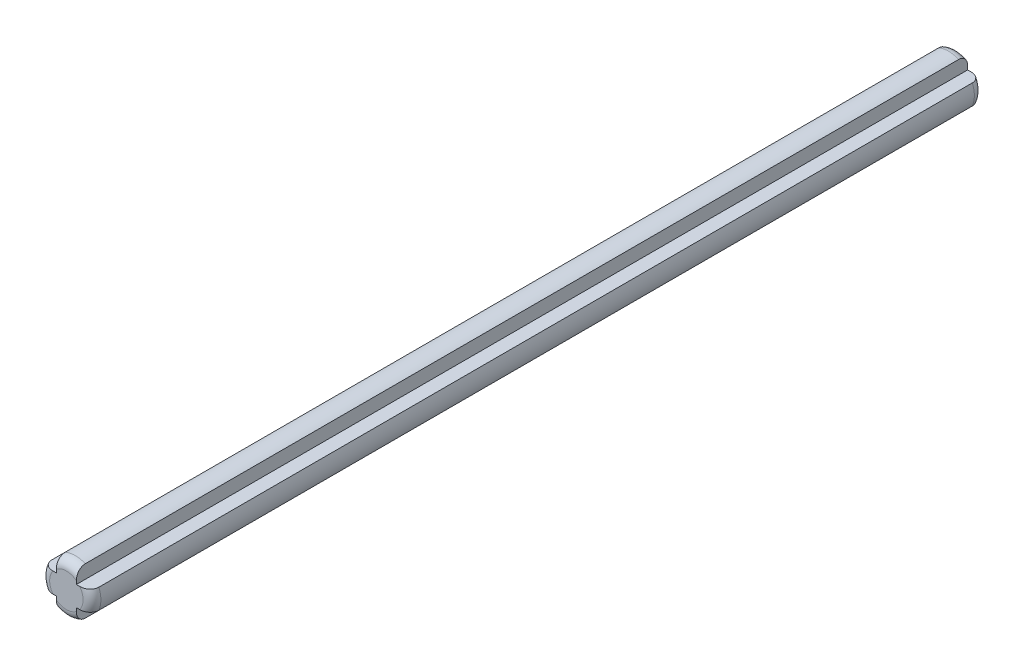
ISO-10303-21;
HEADER;
FILE_DESCRIPTION(('STEP AP214'),'2;1');
FILE_NAME('part.step','',(''),(''),'','','');
FILE_SCHEMA(('AUTOMOTIVE_DESIGN { 1 0 10303 214 1 1 1 1 }'));
ENDSEC;
DATA;
#1=APPLICATION_CONTEXT('core data for automotive mechanical design processes');
#2=APPLICATION_PROTOCOL_DEFINITION('international standard','automotive_design',2000,#1);
#3=PRODUCT_CONTEXT('',#1,'mechanical');
#4=PRODUCT('Part','Part','',(#3));
#5=PRODUCT_RELATED_PRODUCT_CATEGORY('part','',(#4));
#6=PRODUCT_DEFINITION_FORMATION('','',#4);
#7=PRODUCT_DEFINITION_CONTEXT('part definition',#1,'design');
#8=PRODUCT_DEFINITION('design','',#6,#7);
#9=PRODUCT_DEFINITION_SHAPE('','',#8);
#10=(LENGTH_UNIT() NAMED_UNIT(*) SI_UNIT(.MILLI.,.METRE.));
#11=(NAMED_UNIT(*) PLANE_ANGLE_UNIT() SI_UNIT($,.RADIAN.));
#12=(NAMED_UNIT(*) SI_UNIT($,.STERADIAN.) SOLID_ANGLE_UNIT());
#13=UNCERTAINTY_MEASURE_WITH_UNIT(LENGTH_MEASURE(1.E-05),#10,'distance_accuracy_value','');
#14=(GEOMETRIC_REPRESENTATION_CONTEXT(3) GLOBAL_UNCERTAINTY_ASSIGNED_CONTEXT((#13)) GLOBAL_UNIT_ASSIGNED_CONTEXT((#10,
#11,#12)) REPRESENTATION_CONTEXT('',''));
#15=CARTESIAN_POINT('',(0.,0.,0.));
#16=DIRECTION('',(0.,0.,1.));
#17=DIRECTION('',(1.,0.,0.));
#18=AXIS2_PLACEMENT_3D('',#15,#16,#17);
#19=CARTESIAN_POINT('',(0.9,0.,-80.));
#20=DIRECTION('',(-1.,0.,0.));
#21=DIRECTION('',(0.,0.,1.));
#22=AXIS2_PLACEMENT_3D('',#19,#20,#21);
#23=PLANE('',#22);
#24=DIRECTION('',(0.,-1.,0.));
#25=VECTOR('',#24,1.);
#26=CARTESIAN_POINT('',(0.9,0.,-80.));
#27=LINE('',#26,#25);
#28=CARTESIAN_POINT('',(0.9,1.2,-80.));
#29=VERTEX_POINT('',#28);
#30=CARTESIAN_POINT('',(0.9,0.9,-80.));
#31=VERTEX_POINT('',#30);
#32=EDGE_CURVE('E218',#29,#31,#27,.T.);
#33=ORIENTED_EDGE('',*,*,#32,.F.);
#34=CARTESIAN_POINT('',(0.9,1.2,-80.));
#35=CARTESIAN_POINT('',(0.9,1.23177264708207,-79.9999988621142));
#36=CARTESIAN_POINT('',(0.9,1.26353737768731,-79.9987861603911));
#37=CARTESIAN_POINT('',(0.9,1.32690893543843,-79.9937439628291));
#38=CARTESIAN_POINT('',(0.9,1.35851541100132,-79.9899101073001));
#39=CARTESIAN_POINT('',(0.9,1.45291091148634,-79.9741597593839));
#40=CARTESIAN_POINT('',(0.9,1.51508424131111,-79.9579921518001));
#41=CARTESIAN_POINT('',(0.9,1.62122301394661,-79.9186762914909));
#42=CARTESIAN_POINT('',(0.9,1.66610240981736,-79.8979677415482));
#43=CARTESIAN_POINT('',(0.9,1.7517430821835,-79.8494286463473));
#44=CARTESIAN_POINT('',(0.9,1.79251387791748,-79.8216151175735));
#45=CARTESIAN_POINT('',(0.9,1.86875694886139,-79.7590609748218));
#46=CARTESIAN_POINT('',(0.9,1.90419849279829,-79.7242826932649));
#47=CARTESIAN_POINT('',(0.9,1.96804173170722,-79.6487024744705));
#48=CARTESIAN_POINT('',(0.9,1.99643996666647,-79.607897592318));
#49=CARTESIAN_POINT('',(0.9,2.04263429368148,-79.5255349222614));
#50=CARTESIAN_POINT('',(0.9,2.06116131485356,-79.4843855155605));
#51=CARTESIAN_POINT('',(0.9,2.09051404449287,-79.3994647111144));
#52=CARTESIAN_POINT('',(0.9,2.10135386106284,-79.3556982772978));
#53=CARTESIAN_POINT('',(0.9,2.11095369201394,-79.2929302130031));
#54=CARTESIAN_POINT('',(0.9,2.11307132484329,-79.2743928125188));
#55=CARTESIAN_POINT('',(0.9,2.11589349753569,-79.2372401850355));
#56=CARTESIAN_POINT('',(0.9,2.1166002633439,-79.218625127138));
#57=CARTESIAN_POINT('',(0.9,2.11660104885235,-79.2000000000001));
#58=B_SPLINE_CURVE_WITH_KNOTS('',3,(#34,#35,#36,#37,#38,#39,#40,#41,#42,#43,#44,#45,#46,#47,#48,
#49,#50,#51,#52,#53,#54,#55,#56,#57),.UNSPECIFIED.,.F.,.F.,(4,2,2,2,2,2,2,2,2,2,2,4),(0.,
0.0952699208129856,0.19069868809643,0.382124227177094,0.529802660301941,0.677130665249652,
0.825278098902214,0.973498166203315,1.10819470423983,1.24264339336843,1.29857368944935,
1.35441567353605),.UNSPECIFIED.);
#59=CARTESIAN_POINT('',(0.9,2.11660104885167,-79.2));
#60=VERTEX_POINT('',#59);
#61=EDGE_CURVE('E412',#29,#60,#58,.T.);
#62=ORIENTED_EDGE('',*,*,#61,.T.);
#63=DIRECTION('',(0.,0.,1.));
#64=VECTOR('',#63,1.);
#65=CARTESIAN_POINT('',(0.9,2.11660104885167,-80.));
#66=LINE('',#65,#64);
#67=CARTESIAN_POINT('',(0.9,2.11660104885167,-0.799999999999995));
#68=VERTEX_POINT('',#67);
#69=EDGE_CURVE('E255',#60,#68,#66,.T.);
#70=ORIENTED_EDGE('',*,*,#69,.T.);
#71=CARTESIAN_POINT('',(0.9,2.11660104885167,-0.799999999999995));
#72=CARTESIAN_POINT('',(0.9,2.11664820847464,-0.7578675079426));
#73=CARTESIAN_POINT('',(0.9,2.11298761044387,-0.715759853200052));
#74=CARTESIAN_POINT('',(0.9,2.09861504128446,-0.632869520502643));
#75=CARTESIAN_POINT('',(0.9,2.08792060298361,-0.59208381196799));
#76=CARTESIAN_POINT('',(0.9,2.05984193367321,-0.512893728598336));
#77=CARTESIAN_POINT('',(0.9,2.0424580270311,-0.474489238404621));
#78=CARTESIAN_POINT('',(0.9,2.00163237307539,-0.401044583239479));
#79=CARTESIAN_POINT('',(0.9,1.9781885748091,-0.366005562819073));
#80=CARTESIAN_POINT('',(0.9,1.92541056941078,-0.299327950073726));
#81=CARTESIAN_POINT('',(0.9,1.89594969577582,-0.267789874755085));
#82=CARTESIAN_POINT('',(0.9,1.83247761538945,-0.209727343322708));
#83=CARTESIAN_POINT('',(0.9,1.79846712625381,-0.18320209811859));
#84=CARTESIAN_POINT('',(0.9,1.72434385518,-0.133829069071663));
#85=CARTESIAN_POINT('',(0.9,1.68396944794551,-0.111374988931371));
#86=CARTESIAN_POINT('',(0.9,1.60027120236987,-0.0727387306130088));
#87=CARTESIAN_POINT('',(0.9,1.55694210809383,-0.0565680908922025));
#88=CARTESIAN_POINT('',(0.9,1.46195018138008,-0.0284954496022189));
#89=CARTESIAN_POINT('',(0.9,1.40999804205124,-0.0175692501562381));
#90=CARTESIAN_POINT('',(0.9,1.33146710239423,-0.00688571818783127));
#91=CARTESIAN_POINT('',(0.9,1.30523100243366,-0.00427515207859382));
#92=CARTESIAN_POINT('',(0.9,1.25266468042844,-0.000833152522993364));
#93=CARTESIAN_POINT('',(0.9,1.22633456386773,-1.25965898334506E-07));
#94=CARTESIAN_POINT('',(0.9,1.2,0.));
#95=B_SPLINE_CURVE_WITH_KNOTS('',3,(#71,#72,#73,#74,#75,#76,#77,#78,#79,#80,#81,#82,#83,#84,#85,
#86,#87,#88,#89,#90,#91,#92,#93,#94),.UNSPECIFIED.,.F.,.F.,(4,2,2,2,2,2,2,2,2,2,2,4),(0.,
0.12620055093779,0.252087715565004,0.377968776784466,0.503892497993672,0.632806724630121,
0.761700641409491,0.899726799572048,1.03800523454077,1.19659344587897,1.27564166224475,
1.35461900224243),.UNSPECIFIED.);
#96=CARTESIAN_POINT('',(0.9,1.2,0.));
#97=VERTEX_POINT('',#96);
#98=EDGE_CURVE('E420',#68,#97,#95,.T.);
#99=ORIENTED_EDGE('',*,*,#98,.T.);
#100=DIRECTION('',(0.,-1.,0.));
#101=VECTOR('',#100,1.);
#102=CARTESIAN_POINT('',(0.9,0.,0.));
#103=LINE('',#102,#101);
#104=CARTESIAN_POINT('',(0.9,0.9,0.));
#105=VERTEX_POINT('',#104);
#106=EDGE_CURVE('E256',#97,#105,#103,.T.);
#107=ORIENTED_EDGE('',*,*,#106,.T.);
#108=DIRECTION('',(0.,0.,1.));
#109=VECTOR('',#108,1.);
#110=CARTESIAN_POINT('',(0.9,0.9,-80.));
#111=LINE('',#110,#109);
#112=EDGE_CURVE('E282',#31,#105,#111,.T.);
#113=ORIENTED_EDGE('',*,*,#112,.F.);
#114=EDGE_LOOP('',(#33,#62,#70,#99,#107,#113));
#115=FACE_BOUND('',#114,.T.);
#116=ADVANCED_FACE('F59',(#115),#23,.F.);
#117=CARTESIAN_POINT('',(0.,0.9,-80.));
#118=DIRECTION('',(0.,-1.,0.));
#119=DIRECTION('',(0.,0.,-1.));
#120=AXIS2_PLACEMENT_3D('',#117,#118,#119);
#121=PLANE('',#120);
#122=DIRECTION('',(0.,0.,1.));
#123=VECTOR('',#122,1.);
#124=CARTESIAN_POINT('',(2.11660104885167,0.9,-80.));
#125=LINE('',#124,#123);
#126=CARTESIAN_POINT('',(2.11660104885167,0.9,-79.2));
#127=VERTEX_POINT('',#126);
#128=CARTESIAN_POINT('',(2.11660104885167,0.9,-0.799999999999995));
#129=VERTEX_POINT('',#128);
#130=EDGE_CURVE('E287',#127,#129,#125,.T.);
#131=ORIENTED_EDGE('',*,*,#130,.F.);
#132=CARTESIAN_POINT('',(2.11660104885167,0.9,-79.2));
#133=CARTESIAN_POINT('',(2.11664820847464,0.9,-79.2421324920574));
#134=CARTESIAN_POINT('',(2.11298761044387,0.9,-79.2842401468));
#135=CARTESIAN_POINT('',(2.09861504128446,0.9,-79.3671304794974));
#136=CARTESIAN_POINT('',(2.0879206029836,0.9,-79.407916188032));
#137=CARTESIAN_POINT('',(2.05984193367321,0.9,-79.4871062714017));
#138=CARTESIAN_POINT('',(2.0424580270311,0.9,-79.5255107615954));
#139=CARTESIAN_POINT('',(2.00163237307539,0.9,-79.5989554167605));
#140=CARTESIAN_POINT('',(1.97818857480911,0.9,-79.6339944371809));
#141=CARTESIAN_POINT('',(1.92541056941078,0.9,-79.7006720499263));
#142=CARTESIAN_POINT('',(1.89594969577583,0.9,-79.7322101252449));
#143=CARTESIAN_POINT('',(1.83247761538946,0.9,-79.7902726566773));
#144=CARTESIAN_POINT('',(1.79846712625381,0.9,-79.8167979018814));
#145=CARTESIAN_POINT('',(1.72434385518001,0.9,-79.8661709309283));
#146=CARTESIAN_POINT('',(1.68396944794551,0.9,-79.8886250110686));
#147=CARTESIAN_POINT('',(1.60027120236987,0.9,-79.927261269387));
#148=CARTESIAN_POINT('',(1.55694210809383,0.9,-79.9434319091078));
#149=CARTESIAN_POINT('',(1.46195018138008,0.9,-79.9715045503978));
#150=CARTESIAN_POINT('',(1.40999804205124,0.9,-79.9824307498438));
#151=CARTESIAN_POINT('',(1.33146710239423,0.9,-79.9931142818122));
#152=CARTESIAN_POINT('',(1.30523100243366,0.9,-79.9957248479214));
#153=CARTESIAN_POINT('',(1.25266468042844,0.9,-79.999166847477));
#154=CARTESIAN_POINT('',(1.22633456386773,0.9,-79.9999998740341));
#155=CARTESIAN_POINT('',(1.2,0.9,-80.));
#156=B_SPLINE_CURVE_WITH_KNOTS('',3,(#132,#133,#134,#135,#136,#137,#138,#139,#140,#141,#142,
#143,#144,#145,#146,#147,#148,#149,#150,#151,#152,#153,#154,#155),.UNSPECIFIED.,.F.,.F.,(4,2,2,
2,2,2,2,2,2,2,2,4),(0.,0.126200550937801,0.252087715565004,0.377968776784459,0.50389249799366,
0.632806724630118,0.761700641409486,0.899726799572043,1.03800523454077,1.19659344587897,
1.27564166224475,1.35461900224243),.UNSPECIFIED.);
#157=CARTESIAN_POINT('',(1.2,0.9,-80.));
#158=VERTEX_POINT('',#157);
#159=EDGE_CURVE('E338',#127,#158,#156,.T.);
#160=ORIENTED_EDGE('',*,*,#159,.T.);
#161=DIRECTION('',(1.,0.,0.));
#162=VECTOR('',#161,1.);
#163=CARTESIAN_POINT('',(0.,0.9,-80.));
#164=LINE('',#163,#162);
#165=EDGE_CURVE('E252',#31,#158,#164,.T.);
#166=ORIENTED_EDGE('',*,*,#165,.F.);
#167=ORIENTED_EDGE('',*,*,#112,.T.);
#168=DIRECTION('',(1.,0.,0.));
#169=VECTOR('',#168,1.);
#170=CARTESIAN_POINT('',(0.,0.9,0.));
#171=LINE('',#170,#169);
#172=CARTESIAN_POINT('',(1.2,0.9,0.));
#173=VERTEX_POINT('',#172);
#174=EDGE_CURVE('E278',#105,#173,#171,.T.);
#175=ORIENTED_EDGE('',*,*,#174,.T.);
#176=CARTESIAN_POINT('',(1.2,0.9,0.));
#177=CARTESIAN_POINT('',(1.23177264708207,0.9,-1.13788575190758E-06));
#178=CARTESIAN_POINT('',(1.26353737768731,0.9,-0.00121383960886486));
#179=CARTESIAN_POINT('',(1.32690893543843,0.9,-0.00625603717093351));
#180=CARTESIAN_POINT('',(1.35851541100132,0.9,-0.0100898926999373));
#181=CARTESIAN_POINT('',(1.45291091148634,0.9,-0.0258402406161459));
#182=CARTESIAN_POINT('',(1.51508424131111,0.9,-0.0420078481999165));
#183=CARTESIAN_POINT('',(1.62122301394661,0.9,-0.0813237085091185));
#184=CARTESIAN_POINT('',(1.66610240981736,0.9,-0.102032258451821));
#185=CARTESIAN_POINT('',(1.7517430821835,0.9,-0.150571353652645));
#186=CARTESIAN_POINT('',(1.79251387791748,0.9,-0.178384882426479));
#187=CARTESIAN_POINT('',(1.8687569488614,0.9,-0.240939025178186));
#188=CARTESIAN_POINT('',(1.9041984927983,0.9,-0.275717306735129));
#189=CARTESIAN_POINT('',(1.96804173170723,0.9,-0.351297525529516));
#190=CARTESIAN_POINT('',(1.99643996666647,0.9,-0.392102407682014));
#191=CARTESIAN_POINT('',(2.04263429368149,0.9,-0.474465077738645));
#192=CARTESIAN_POINT('',(2.06116131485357,0.9,-0.515614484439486));
#193=CARTESIAN_POINT('',(2.09051404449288,0.9,-0.600535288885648));
#194=CARTESIAN_POINT('',(2.10135386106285,0.9,-0.644301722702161));
#195=CARTESIAN_POINT('',(2.11095369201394,0.9,-0.707069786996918));
#196=CARTESIAN_POINT('',(2.11307132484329,0.9,-0.725607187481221));
#197=CARTESIAN_POINT('',(2.11589349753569,0.9,-0.762759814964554));
#198=CARTESIAN_POINT('',(2.1166002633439,0.9,-0.781374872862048));
#199=CARTESIAN_POINT('',(2.11660104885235,0.9,-0.799999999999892));
#200=B_SPLINE_CURVE_WITH_KNOTS('',3,(#176,#177,#178,#179,#180,#181,#182,#183,#184,#185,#186,
#187,#188,#189,#190,#191,#192,#193,#194,#195,#196,#197,#198,#199),.UNSPECIFIED.,.F.,.F.,(4,2,2,
2,2,2,2,2,2,2,2,4),(0.,0.0952699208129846,0.190698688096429,0.382124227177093,0.529802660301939,
0.677130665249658,0.82527809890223,0.973498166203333,1.10819470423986,1.24264339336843,
1.29857368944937,1.35441567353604),.UNSPECIFIED.);
#201=EDGE_CURVE('E329',#173,#129,#200,.T.);
#202=ORIENTED_EDGE('',*,*,#201,.T.);
#203=EDGE_LOOP('',(#131,#160,#166,#167,#175,#202));
#204=FACE_BOUND('',#203,.T.);
#205=ADVANCED_FACE('F348',(#204),#121,.F.);
#206=CARTESIAN_POINT('',(0.,0.,-80.));
#207=DIRECTION('',(0.,0.,1.));
#208=DIRECTION('',(1.,0.,0.));
#209=AXIS2_PLACEMENT_3D('',#206,#207,#208);
#210=CYLINDRICAL_SURFACE('',#209,2.3);
#211=DIRECTION('',(0.,0.,1.));
#212=VECTOR('',#211,1.);
#213=CARTESIAN_POINT('',(2.11660104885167,-0.9,-80.));
#214=LINE('',#213,#212);
#215=CARTESIAN_POINT('',(2.11660104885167,-0.9,-79.2));
#216=VERTEX_POINT('',#215);
#217=CARTESIAN_POINT('',(2.11660104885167,-0.9,-0.799999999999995));
#218=VERTEX_POINT('',#217);
#219=EDGE_CURVE('E291',#216,#218,#214,.T.);
#220=ORIENTED_EDGE('',*,*,#219,.F.);
#221=CARTESIAN_POINT('',(0.,0.,-79.2));
#222=DIRECTION('',(0.,0.,1.));
#223=DIRECTION('',(1.,0.,0.));
#224=AXIS2_PLACEMENT_3D('',#221,#222,#223);
#225=CIRCLE('',#224,2.3);
#226=EDGE_CURVE('E325',#216,#127,#225,.T.);
#227=ORIENTED_EDGE('',*,*,#226,.T.);
#228=ORIENTED_EDGE('',*,*,#130,.T.);
#229=CARTESIAN_POINT('',(0.,0.,-0.799999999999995));
#230=DIRECTION('',(0.,0.,1.));
#231=DIRECTION('',(1.,0.,0.));
#232=AXIS2_PLACEMENT_3D('',#229,#230,#231);
#233=CIRCLE('',#232,2.3);
#234=EDGE_CURVE('E286',#129,#218,#233,.F.);
#235=ORIENTED_EDGE('',*,*,#234,.T.);
#236=EDGE_LOOP('',(#220,#227,#228,#235));
#237=FACE_BOUND('',#236,.T.);
#238=ADVANCED_FACE('F353',(#237),#210,.T.);
#239=CARTESIAN_POINT('',(0.,-0.9,-80.));
#240=DIRECTION('',(0.,-1.,0.));
#241=DIRECTION('',(0.,0.,-1.));
#242=AXIS2_PLACEMENT_3D('',#239,#240,#241);
#243=PLANE('',#242);
#244=DIRECTION('',(1.,0.,0.));
#245=VECTOR('',#244,1.);
#246=CARTESIAN_POINT('',(0.,-0.9,-80.));
#247=LINE('',#246,#245);
#248=CARTESIAN_POINT('',(0.9,-0.9,-80.));
#249=VERTEX_POINT('',#248);
#250=CARTESIAN_POINT('',(1.2,-0.9,-80.));
#251=VERTEX_POINT('',#250);
#252=EDGE_CURVE('E248',#249,#251,#247,.T.);
#253=ORIENTED_EDGE('',*,*,#252,.T.);
#254=CARTESIAN_POINT('',(1.2,-0.9,-80.));
#255=CARTESIAN_POINT('',(1.23177264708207,-0.9,-79.9999988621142));
#256=CARTESIAN_POINT('',(1.26353737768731,-0.9,-79.9987861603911));
#257=CARTESIAN_POINT('',(1.32690893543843,-0.9,-79.9937439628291));
#258=CARTESIAN_POINT('',(1.35851541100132,-0.9,-79.9899101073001));
#259=CARTESIAN_POINT('',(1.45291091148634,-0.9,-79.9741597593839));
#260=CARTESIAN_POINT('',(1.51508424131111,-0.9,-79.9579921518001));
#261=CARTESIAN_POINT('',(1.62122301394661,-0.9,-79.9186762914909));
#262=CARTESIAN_POINT('',(1.66610240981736,-0.9,-79.8979677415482));
#263=CARTESIAN_POINT('',(1.7517430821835,-0.9,-79.8494286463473));
#264=CARTESIAN_POINT('',(1.79251387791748,-0.9,-79.8216151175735));
#265=CARTESIAN_POINT('',(1.8687569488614,-0.9,-79.7590609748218));
#266=CARTESIAN_POINT('',(1.90419849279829,-0.9,-79.7242826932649));
#267=CARTESIAN_POINT('',(1.96804173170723,-0.9,-79.6487024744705));
#268=CARTESIAN_POINT('',(1.99643996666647,-0.9,-79.607897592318));
#269=CARTESIAN_POINT('',(2.04263429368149,-0.9,-79.5255349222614));
#270=CARTESIAN_POINT('',(2.06116131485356,-0.9,-79.4843855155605));
#271=CARTESIAN_POINT('',(2.09051404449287,-0.9,-79.3994647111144));
#272=CARTESIAN_POINT('',(2.10135386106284,-0.9,-79.3556982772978));
#273=CARTESIAN_POINT('',(2.11095369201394,-0.9,-79.2929302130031));
#274=CARTESIAN_POINT('',(2.11307132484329,-0.9,-79.2743928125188));
#275=CARTESIAN_POINT('',(2.11589349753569,-0.9,-79.2372401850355));
#276=CARTESIAN_POINT('',(2.1166002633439,-0.9,-79.218625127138));
#277=CARTESIAN_POINT('',(2.11660104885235,-0.9,-79.2000000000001));
#278=B_SPLINE_CURVE_WITH_KNOTS('',3,(#254,#255,#256,#257,#258,#259,#260,#261,#262,#263,#264,
#265,#266,#267,#268,#269,#270,#271,#272,#273,#274,#275,#276,#277),.UNSPECIFIED.,.F.,.F.,(4,2,2,
2,2,2,2,2,2,2,2,4),(0.,0.0952699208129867,0.190698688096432,0.382124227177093,0.529802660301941,
0.677130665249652,0.825278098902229,0.973498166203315,1.10819470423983,1.24264339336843,
1.29857368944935,1.35441567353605),.UNSPECIFIED.);
#279=EDGE_CURVE('E379',#251,#216,#278,.T.);
#280=ORIENTED_EDGE('',*,*,#279,.T.);
#281=ORIENTED_EDGE('',*,*,#219,.T.);
#282=CARTESIAN_POINT('',(2.11660104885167,-0.9,-0.799999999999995));
#283=CARTESIAN_POINT('',(2.11664820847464,-0.9,-0.757867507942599));
#284=CARTESIAN_POINT('',(2.11298761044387,-0.9,-0.715759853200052));
#285=CARTESIAN_POINT('',(2.09861504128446,-0.9,-0.632869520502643));
#286=CARTESIAN_POINT('',(2.0879206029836,-0.9,-0.59208381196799));
#287=CARTESIAN_POINT('',(2.05984193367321,-0.9,-0.512893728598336));
#288=CARTESIAN_POINT('',(2.0424580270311,-0.9,-0.47448923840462));
#289=CARTESIAN_POINT('',(2.00163237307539,-0.9,-0.401044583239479));
#290=CARTESIAN_POINT('',(1.9781885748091,-0.9,-0.366005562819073));
#291=CARTESIAN_POINT('',(1.92541056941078,-0.9,-0.299327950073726));
#292=CARTESIAN_POINT('',(1.89594969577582,-0.9,-0.267789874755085));
#293=CARTESIAN_POINT('',(1.83247761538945,-0.9,-0.209727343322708));
#294=CARTESIAN_POINT('',(1.79846712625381,-0.9,-0.183202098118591));
#295=CARTESIAN_POINT('',(1.72434385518,-0.9,-0.133829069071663));
#296=CARTESIAN_POINT('',(1.68396944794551,-0.9,-0.111374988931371));
#297=CARTESIAN_POINT('',(1.60027120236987,-0.9,-0.0727387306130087));
#298=CARTESIAN_POINT('',(1.55694210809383,-0.9,-0.0565680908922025));
#299=CARTESIAN_POINT('',(1.46195018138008,-0.9,-0.0284954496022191));
#300=CARTESIAN_POINT('',(1.40999804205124,-0.9,-0.0175692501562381));
#301=CARTESIAN_POINT('',(1.33146710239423,-0.9,-0.00688571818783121));
#302=CARTESIAN_POINT('',(1.30523100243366,-0.9,-0.00427515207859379));
#303=CARTESIAN_POINT('',(1.25266468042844,-0.9,-0.000833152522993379));
#304=CARTESIAN_POINT('',(1.22633456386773,-0.9,-1.25965898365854E-07));
#305=CARTESIAN_POINT('',(1.2,-0.9,0.));
#306=B_SPLINE_CURVE_WITH_KNOTS('',3,(#282,#283,#284,#285,#286,#287,#288,#289,#290,#291,#292,
#293,#294,#295,#296,#297,#298,#299,#300,#301,#302,#303,#304,#305),.UNSPECIFIED.,.F.,.F.,(4,2,2,
2,2,2,2,2,2,2,2,4),(0.,0.126200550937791,0.252087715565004,0.377968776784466,0.503892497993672,
0.632806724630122,0.761700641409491,0.899726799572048,1.03800523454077,1.19659344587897,
1.27564166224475,1.35461900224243),.UNSPECIFIED.);
#307=CARTESIAN_POINT('',(1.2,-0.9,0.));
#308=VERTEX_POINT('',#307);
#309=EDGE_CURVE('E372',#218,#308,#306,.T.);
#310=ORIENTED_EDGE('',*,*,#309,.T.);
#311=DIRECTION('',(1.,0.,0.));
#312=VECTOR('',#311,1.);
#313=CARTESIAN_POINT('',(0.,-0.9,0.));
#314=LINE('',#313,#312);
#315=CARTESIAN_POINT('',(0.9,-0.9,0.));
#316=VERTEX_POINT('',#315);
#317=EDGE_CURVE('E274',#316,#308,#314,.T.);
#318=ORIENTED_EDGE('',*,*,#317,.F.);
#319=DIRECTION('',(0.,0.,1.));
#320=VECTOR('',#319,1.);
#321=CARTESIAN_POINT('',(0.9,-0.9,-80.));
#322=LINE('',#321,#320);
#323=EDGE_CURVE('E295',#249,#316,#322,.T.);
#324=ORIENTED_EDGE('',*,*,#323,.F.);
#325=EDGE_LOOP('',(#253,#280,#281,#310,#318,#324));
#326=FACE_BOUND('',#325,.T.);
#327=ADVANCED_FACE('F360',(#326),#243,.T.);
#328=CARTESIAN_POINT('',(0.9,0.,-80.));
#329=DIRECTION('',(1.,0.,0.));
#330=DIRECTION('',(0.,0.,-1.));
#331=AXIS2_PLACEMENT_3D('',#328,#329,#330);
#332=PLANE('',#331);
#333=DIRECTION('',(0.,0.,1.));
#334=VECTOR('',#333,1.);
#335=CARTESIAN_POINT('',(0.9,-2.11660104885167,-80.));
#336=LINE('',#335,#334);
#337=CARTESIAN_POINT('',(0.9,-2.11660104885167,-79.2));
#338=VERTEX_POINT('',#337);
#339=CARTESIAN_POINT('',(0.9,-2.11660104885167,-0.799999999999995));
#340=VERTEX_POINT('',#339);
#341=EDGE_CURVE('E299',#338,#340,#336,.T.);
#342=ORIENTED_EDGE('',*,*,#341,.F.);
#343=CARTESIAN_POINT('',(0.9,-2.11660104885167,-79.2));
#344=CARTESIAN_POINT('',(0.9,-2.11664820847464,-79.2421324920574));
#345=CARTESIAN_POINT('',(0.9,-2.11298761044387,-79.2842401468));
#346=CARTESIAN_POINT('',(0.9,-2.09861504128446,-79.3671304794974));
#347=CARTESIAN_POINT('',(0.9,-2.0879206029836,-79.407916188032));
#348=CARTESIAN_POINT('',(0.9,-2.05984193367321,-79.4871062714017));
#349=CARTESIAN_POINT('',(0.9,-2.0424580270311,-79.5255107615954));
#350=CARTESIAN_POINT('',(0.9,-2.00163237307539,-79.5989554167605));
#351=CARTESIAN_POINT('',(0.9,-1.97818857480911,-79.6339944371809));
#352=CARTESIAN_POINT('',(0.9,-1.92541056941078,-79.7006720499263));
#353=CARTESIAN_POINT('',(0.9,-1.89594969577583,-79.7322101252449));
#354=CARTESIAN_POINT('',(0.9,-1.83247761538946,-79.7902726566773));
#355=CARTESIAN_POINT('',(0.9,-1.79846712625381,-79.8167979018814));
#356=CARTESIAN_POINT('',(0.9,-1.72434385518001,-79.8661709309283));
#357=CARTESIAN_POINT('',(0.9,-1.68396944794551,-79.8886250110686));
#358=CARTESIAN_POINT('',(0.9,-1.60027120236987,-79.927261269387));
#359=CARTESIAN_POINT('',(0.9,-1.55694210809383,-79.9434319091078));
#360=CARTESIAN_POINT('',(0.9,-1.46195018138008,-79.9715045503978));
#361=CARTESIAN_POINT('',(0.9,-1.40999804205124,-79.9824307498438));
#362=CARTESIAN_POINT('',(0.9,-1.33146710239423,-79.9931142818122));
#363=CARTESIAN_POINT('',(0.9,-1.30523100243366,-79.9957248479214));
#364=CARTESIAN_POINT('',(0.9,-1.25266468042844,-79.999166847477));
#365=CARTESIAN_POINT('',(0.9,-1.22633456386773,-79.9999998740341));
#366=CARTESIAN_POINT('',(0.9,-1.2,-80.));
#367=B_SPLINE_CURVE_WITH_KNOTS('',3,(#343,#344,#345,#346,#347,#348,#349,#350,#351,#352,#353,
#354,#355,#356,#357,#358,#359,#360,#361,#362,#363,#364,#365,#366),.UNSPECIFIED.,.F.,.F.,(4,2,2,
2,2,2,2,2,2,2,2,4),(0.,0.126200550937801,0.252087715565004,0.377968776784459,0.50389249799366,
0.632806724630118,0.761700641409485,0.899726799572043,1.03800523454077,1.19659344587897,
1.27564166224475,1.35461900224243),.UNSPECIFIED.);
#368=CARTESIAN_POINT('',(0.9,-1.2,-80.));
#369=VERTEX_POINT('',#368);
#370=EDGE_CURVE('E90',#338,#369,#367,.T.);
#371=ORIENTED_EDGE('',*,*,#370,.T.);
#372=DIRECTION('',(0.,1.,0.));
#373=VECTOR('',#372,1.);
#374=CARTESIAN_POINT('',(0.9,0.,-80.));
#375=LINE('',#374,#373);
#376=EDGE_CURVE('E245',#369,#249,#375,.T.);
#377=ORIENTED_EDGE('',*,*,#376,.T.);
#378=ORIENTED_EDGE('',*,*,#323,.T.);
#379=DIRECTION('',(0.,1.,0.));
#380=VECTOR('',#379,1.);
#381=CARTESIAN_POINT('',(0.9,0.,0.));
#382=LINE('',#381,#380);
#383=CARTESIAN_POINT('',(0.9,-1.2,0.));
#384=VERTEX_POINT('',#383);
#385=EDGE_CURVE('E271',#384,#316,#382,.T.);
#386=ORIENTED_EDGE('',*,*,#385,.F.);
#387=CARTESIAN_POINT('',(0.9,-1.2,0.));
#388=CARTESIAN_POINT('',(0.9,-1.23177264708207,-1.13788575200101E-06));
#389=CARTESIAN_POINT('',(0.9,-1.26353737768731,-0.00121383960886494));
#390=CARTESIAN_POINT('',(0.9,-1.32690893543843,-0.00625603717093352));
#391=CARTESIAN_POINT('',(0.9,-1.35851541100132,-0.0100898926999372));
#392=CARTESIAN_POINT('',(0.9,-1.45291091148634,-0.0258402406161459));
#393=CARTESIAN_POINT('',(0.9,-1.51508424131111,-0.0420078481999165));
#394=CARTESIAN_POINT('',(0.9,-1.62122301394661,-0.0813237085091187));
#395=CARTESIAN_POINT('',(0.9,-1.66610240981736,-0.102032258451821));
#396=CARTESIAN_POINT('',(0.9,-1.7517430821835,-0.150571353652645));
#397=CARTESIAN_POINT('',(0.9,-1.79251387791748,-0.178384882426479));
#398=CARTESIAN_POINT('',(0.9,-1.8687569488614,-0.240939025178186));
#399=CARTESIAN_POINT('',(0.9,-1.9041984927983,-0.275717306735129));
#400=CARTESIAN_POINT('',(0.9,-1.96804173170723,-0.351297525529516));
#401=CARTESIAN_POINT('',(0.9,-1.99643996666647,-0.392102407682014));
#402=CARTESIAN_POINT('',(0.9,-2.04263429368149,-0.474465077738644));
#403=CARTESIAN_POINT('',(0.9,-2.06116131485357,-0.515614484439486));
#404=CARTESIAN_POINT('',(0.9,-2.09051404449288,-0.600535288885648));
#405=CARTESIAN_POINT('',(0.9,-2.10135386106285,-0.64430172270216));
#406=CARTESIAN_POINT('',(0.9,-2.11095369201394,-0.707069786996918));
#407=CARTESIAN_POINT('',(0.9,-2.11307132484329,-0.725607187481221));
#408=CARTESIAN_POINT('',(0.9,-2.11589349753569,-0.762759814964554));
#409=CARTESIAN_POINT('',(0.9,-2.1166002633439,-0.781374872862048));
#410=CARTESIAN_POINT('',(0.9,-2.11660104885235,-0.799999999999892));
#411=B_SPLINE_CURVE_WITH_KNOTS('',3,(#387,#388,#389,#390,#391,#392,#393,#394,#395,#396,#397,
#398,#399,#400,#401,#402,#403,#404,#405,#406,#407,#408,#409,#410),.UNSPECIFIED.,.F.,.F.,(4,2,2,
2,2,2,2,2,2,2,2,4),(0.,0.0952699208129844,0.190698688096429,0.382124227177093,0.52980266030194,
0.677130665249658,0.82527809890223,0.973498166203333,1.10819470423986,1.24264339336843,
1.29857368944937,1.35441567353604),.UNSPECIFIED.);
#412=EDGE_CURVE('E82',#384,#340,#411,.T.);
#413=ORIENTED_EDGE('',*,*,#412,.T.);
#414=EDGE_LOOP('',(#342,#371,#377,#378,#386,#413));
#415=FACE_BOUND('',#414,.T.);
#416=ADVANCED_FACE('F367',(#415),#332,.T.);
#417=DIRECTION('',(0.,0.,1.));
#418=VECTOR('',#417,1.);
#419=CARTESIAN_POINT('',(-0.9,-2.11660104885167,-80.));
#420=LINE('',#419,#418);
#421=CARTESIAN_POINT('',(-0.9,-2.11660104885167,-79.2));
#422=VERTEX_POINT('',#421);
#423=CARTESIAN_POINT('',(-0.9,-2.11660104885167,-0.799999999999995));
#424=VERTEX_POINT('',#423);
#425=EDGE_CURVE('E302',#422,#424,#420,.T.);
#426=ORIENTED_EDGE('',*,*,#425,.F.);
#427=CARTESIAN_POINT('',(0.,0.,-79.2));
#428=DIRECTION('',(0.,0.,1.));
#429=DIRECTION('',(1.,0.,0.));
#430=AXIS2_PLACEMENT_3D('',#427,#428,#429);
#431=CIRCLE('',#430,2.3);
#432=EDGE_CURVE('E493',#422,#338,#431,.T.);
#433=ORIENTED_EDGE('',*,*,#432,.T.);
#434=ORIENTED_EDGE('',*,*,#341,.T.);
#435=CARTESIAN_POINT('',(0.,0.,-0.799999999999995));
#436=DIRECTION('',(0.,0.,1.));
#437=DIRECTION('',(1.,0.,0.));
#438=AXIS2_PLACEMENT_3D('',#435,#436,#437);
#439=CIRCLE('',#438,2.3);
#440=EDGE_CURVE('E490',#340,#424,#439,.F.);
#441=ORIENTED_EDGE('',*,*,#440,.T.);
#442=EDGE_LOOP('',(#426,#433,#434,#441));
#443=FACE_BOUND('',#442,.T.);
#444=ADVANCED_FACE('F363',(#443),#210,.T.);
#445=CARTESIAN_POINT('',(-0.9,0.,-80.));
#446=DIRECTION('',(1.,0.,0.));
#447=DIRECTION('',(0.,0.,-1.));
#448=AXIS2_PLACEMENT_3D('',#445,#446,#447);
#449=PLANE('',#448);
#450=DIRECTION('',(0.,1.,0.));
#451=VECTOR('',#450,1.);
#452=CARTESIAN_POINT('',(-0.9,0.,-80.));
#453=LINE('',#452,#451);
#454=CARTESIAN_POINT('',(-0.9,-1.2,-80.));
#455=VERTEX_POINT('',#454);
#456=CARTESIAN_POINT('',(-0.9,-0.9,-80.));
#457=VERTEX_POINT('',#456);
#458=EDGE_CURVE('E239',#455,#457,#453,.T.);
#459=ORIENTED_EDGE('',*,*,#458,.F.);
#460=CARTESIAN_POINT('',(-0.9,-1.2,-80.));
#461=CARTESIAN_POINT('',(-0.9,-1.23177264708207,-79.9999988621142));
#462=CARTESIAN_POINT('',(-0.9,-1.26353737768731,-79.9987861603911));
#463=CARTESIAN_POINT('',(-0.9,-1.32690893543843,-79.9937439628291));
#464=CARTESIAN_POINT('',(-0.9,-1.35851541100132,-79.9899101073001));
#465=CARTESIAN_POINT('',(-0.9,-1.45291091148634,-79.9741597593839));
#466=CARTESIAN_POINT('',(-0.9,-1.51508424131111,-79.9579921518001));
#467=CARTESIAN_POINT('',(-0.9,-1.62122301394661,-79.9186762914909));
#468=CARTESIAN_POINT('',(-0.9,-1.66610240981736,-79.8979677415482));
#469=CARTESIAN_POINT('',(-0.9,-1.7517430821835,-79.8494286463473));
#470=CARTESIAN_POINT('',(-0.9,-1.79251387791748,-79.8216151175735));
#471=CARTESIAN_POINT('',(-0.9,-1.86875694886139,-79.7590609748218));
#472=CARTESIAN_POINT('',(-0.9,-1.90419849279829,-79.7242826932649));
#473=CARTESIAN_POINT('',(-0.9,-1.96804173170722,-79.6487024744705));
#474=CARTESIAN_POINT('',(-0.9,-1.99643996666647,-79.607897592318));
#475=CARTESIAN_POINT('',(-0.9,-2.04263429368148,-79.5255349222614));
#476=CARTESIAN_POINT('',(-0.9,-2.06116131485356,-79.4843855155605));
#477=CARTESIAN_POINT('',(-0.9,-2.09051404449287,-79.3994647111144));
#478=CARTESIAN_POINT('',(-0.9,-2.10135386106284,-79.3556982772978));
#479=CARTESIAN_POINT('',(-0.9,-2.11095369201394,-79.2929302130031));
#480=CARTESIAN_POINT('',(-0.9,-2.11307132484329,-79.2743928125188));
#481=CARTESIAN_POINT('',(-0.9,-2.11589349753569,-79.2372401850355));
#482=CARTESIAN_POINT('',(-0.9,-2.1166002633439,-79.218625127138));
#483=CARTESIAN_POINT('',(-0.9,-2.11660104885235,-79.2000000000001));
#484=B_SPLINE_CURVE_WITH_KNOTS('',3,(#460,#461,#462,#463,#464,#465,#466,#467,#468,#469,#470,
#471,#472,#473,#474,#475,#476,#477,#478,#479,#480,#481,#482,#483),.UNSPECIFIED.,.F.,.F.,(4,2,2,
2,2,2,2,2,2,2,2,4),(0.,0.0952699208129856,0.19069868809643,0.382124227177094,0.529802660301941,
0.677130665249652,0.825278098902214,0.973498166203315,1.10819470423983,1.24264339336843,
1.29857368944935,1.35441567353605),.UNSPECIFIED.);
#485=EDGE_CURVE('E13',#455,#422,#484,.T.);
#486=ORIENTED_EDGE('',*,*,#485,.T.);
#487=ORIENTED_EDGE('',*,*,#425,.T.);
#488=CARTESIAN_POINT('',(-0.9,-2.11660104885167,-0.799999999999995));
#489=CARTESIAN_POINT('',(-0.9,-2.11664820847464,-0.7578675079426));
#490=CARTESIAN_POINT('',(-0.9,-2.11298761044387,-0.715759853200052));
#491=CARTESIAN_POINT('',(-0.9,-2.09861504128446,-0.632869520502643));
#492=CARTESIAN_POINT('',(-0.9,-2.08792060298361,-0.59208381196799));
#493=CARTESIAN_POINT('',(-0.9,-2.05984193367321,-0.512893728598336));
#494=CARTESIAN_POINT('',(-0.9,-2.0424580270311,-0.474489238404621));
#495=CARTESIAN_POINT('',(-0.9,-2.00163237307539,-0.401044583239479));
#496=CARTESIAN_POINT('',(-0.9,-1.9781885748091,-0.366005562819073));
#497=CARTESIAN_POINT('',(-0.9,-1.92541056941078,-0.299327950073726));
#498=CARTESIAN_POINT('',(-0.9,-1.89594969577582,-0.267789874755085));
#499=CARTESIAN_POINT('',(-0.9,-1.83247761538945,-0.209727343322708));
#500=CARTESIAN_POINT('',(-0.9,-1.79846712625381,-0.18320209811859));
#501=CARTESIAN_POINT('',(-0.9,-1.72434385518,-0.133829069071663));
#502=CARTESIAN_POINT('',(-0.9,-1.68396944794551,-0.111374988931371));
#503=CARTESIAN_POINT('',(-0.9,-1.60027120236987,-0.0727387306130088));
#504=CARTESIAN_POINT('',(-0.9,-1.55694210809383,-0.0565680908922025));
#505=CARTESIAN_POINT('',(-0.9,-1.46195018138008,-0.0284954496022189));
#506=CARTESIAN_POINT('',(-0.9,-1.40999804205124,-0.0175692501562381));
#507=CARTESIAN_POINT('',(-0.9,-1.33146710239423,-0.00688571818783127));
#508=CARTESIAN_POINT('',(-0.9,-1.30523100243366,-0.00427515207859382));
#509=CARTESIAN_POINT('',(-0.9,-1.25266468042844,-0.000833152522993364));
#510=CARTESIAN_POINT('',(-0.9,-1.22633456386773,-1.25965898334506E-07));
#511=CARTESIAN_POINT('',(-0.9,-1.2,0.));
#512=B_SPLINE_CURVE_WITH_KNOTS('',3,(#488,#489,#490,#491,#492,#493,#494,#495,#496,#497,#498,
#499,#500,#501,#502,#503,#504,#505,#506,#507,#508,#509,#510,#511),.UNSPECIFIED.,.F.,.F.,(4,2,2,
2,2,2,2,2,2,2,2,4),(0.,0.12620055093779,0.252087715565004,0.377968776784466,0.503892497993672,
0.632806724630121,0.761700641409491,0.899726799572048,1.03800523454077,1.19659344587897,
1.27564166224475,1.35461900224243),.UNSPECIFIED.);
#513=CARTESIAN_POINT('',(-0.9,-1.2,0.));
#514=VERTEX_POINT('',#513);
#515=EDGE_CURVE('E75',#424,#514,#512,.T.);
#516=ORIENTED_EDGE('',*,*,#515,.T.);
#517=DIRECTION('',(0.,1.,0.));
#518=VECTOR('',#517,1.);
#519=CARTESIAN_POINT('',(-0.9,0.,0.));
#520=LINE('',#519,#518);
#521=CARTESIAN_POINT('',(-0.9,-0.9,0.));
#522=VERTEX_POINT('',#521);
#523=EDGE_CURVE('E268',#514,#522,#520,.T.);
#524=ORIENTED_EDGE('',*,*,#523,.T.);
#525=DIRECTION('',(0.,0.,1.));
#526=VECTOR('',#525,1.);
#527=CARTESIAN_POINT('',(-0.9,-0.9,-80.));
#528=LINE('',#527,#526);
#529=EDGE_CURVE('E306',#457,#522,#528,.T.);
#530=ORIENTED_EDGE('',*,*,#529,.F.);
#531=EDGE_LOOP('',(#459,#486,#487,#516,#524,#530));
#532=FACE_BOUND('',#531,.T.);
#533=ADVANCED_FACE('F453',(#532),#449,.F.);
#534=CARTESIAN_POINT('',(0.,-0.9,-80.));
#535=DIRECTION('',(0.,1.,0.));
#536=DIRECTION('',(0.,0.,1.));
#537=AXIS2_PLACEMENT_3D('',#534,#535,#536);
#538=PLANE('',#537);
#539=DIRECTION('',(0.,0.,1.));
#540=VECTOR('',#539,1.);
#541=CARTESIAN_POINT('',(-2.11660104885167,-0.9,-80.));
#542=LINE('',#541,#540);
#543=CARTESIAN_POINT('',(-2.11660104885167,-0.9,-79.2));
#544=VERTEX_POINT('',#543);
#545=CARTESIAN_POINT('',(-2.11660104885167,-0.9,-0.799999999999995));
#546=VERTEX_POINT('',#545);
#547=EDGE_CURVE('E310',#544,#546,#542,.T.);
#548=ORIENTED_EDGE('',*,*,#547,.F.);
#549=CARTESIAN_POINT('',(-2.11660104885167,-0.9,-79.2));
#550=CARTESIAN_POINT('',(-2.11664820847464,-0.9,-79.2421324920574));
#551=CARTESIAN_POINT('',(-2.11298761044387,-0.9,-79.2842401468));
#552=CARTESIAN_POINT('',(-2.09861504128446,-0.9,-79.3671304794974));
#553=CARTESIAN_POINT('',(-2.0879206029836,-0.9,-79.407916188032));
#554=CARTESIAN_POINT('',(-2.05984193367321,-0.9,-79.4871062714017));
#555=CARTESIAN_POINT('',(-2.0424580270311,-0.9,-79.5255107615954));
#556=CARTESIAN_POINT('',(-2.00163237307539,-0.9,-79.5989554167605));
#557=CARTESIAN_POINT('',(-1.97818857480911,-0.9,-79.6339944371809));
#558=CARTESIAN_POINT('',(-1.92541056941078,-0.9,-79.7006720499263));
#559=CARTESIAN_POINT('',(-1.89594969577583,-0.9,-79.7322101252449));
#560=CARTESIAN_POINT('',(-1.83247761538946,-0.9,-79.7902726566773));
#561=CARTESIAN_POINT('',(-1.79846712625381,-0.9,-79.8167979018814));
#562=CARTESIAN_POINT('',(-1.72434385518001,-0.9,-79.8661709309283));
#563=CARTESIAN_POINT('',(-1.68396944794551,-0.9,-79.8886250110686));
#564=CARTESIAN_POINT('',(-1.60027120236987,-0.9,-79.927261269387));
#565=CARTESIAN_POINT('',(-1.55694210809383,-0.9,-79.9434319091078));
#566=CARTESIAN_POINT('',(-1.46195018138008,-0.9,-79.9715045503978));
#567=CARTESIAN_POINT('',(-1.40999804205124,-0.9,-79.9824307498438));
#568=CARTESIAN_POINT('',(-1.33146710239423,-0.9,-79.9931142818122));
#569=CARTESIAN_POINT('',(-1.30523100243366,-0.9,-79.9957248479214));
#570=CARTESIAN_POINT('',(-1.25266468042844,-0.9,-79.999166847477));
#571=CARTESIAN_POINT('',(-1.22633456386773,-0.9,-79.9999998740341));
#572=CARTESIAN_POINT('',(-1.2,-0.9,-80.));
#573=B_SPLINE_CURVE_WITH_KNOTS('',3,(#549,#550,#551,#552,#553,#554,#555,#556,#557,#558,#559,
#560,#561,#562,#563,#564,#565,#566,#567,#568,#569,#570,#571,#572),.UNSPECIFIED.,.F.,.F.,(4,2,2,
2,2,2,2,2,2,2,2,4),(0.,0.126200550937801,0.252087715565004,0.377968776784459,0.50389249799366,
0.632806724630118,0.761700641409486,0.899726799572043,1.03800523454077,1.19659344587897,
1.27564166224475,1.35461900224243),.UNSPECIFIED.);
#574=CARTESIAN_POINT('',(-1.2,-0.9,-80.));
#575=VERTEX_POINT('',#574);
#576=EDGE_CURVE('E439',#544,#575,#573,.T.);
#577=ORIENTED_EDGE('',*,*,#576,.T.);
#578=DIRECTION('',(-1.,0.,0.));
#579=VECTOR('',#578,1.);
#580=CARTESIAN_POINT('',(0.,-0.9,-80.));
#581=LINE('',#580,#579);
#582=EDGE_CURVE('E236',#457,#575,#581,.T.);
#583=ORIENTED_EDGE('',*,*,#582,.F.);
#584=ORIENTED_EDGE('',*,*,#529,.T.);
#585=DIRECTION('',(-1.,0.,0.));
#586=VECTOR('',#585,1.);
#587=CARTESIAN_POINT('',(0.,-0.9,0.));
#588=LINE('',#587,#586);
#589=CARTESIAN_POINT('',(-1.2,-0.9,0.));
#590=VERTEX_POINT('',#589);
#591=EDGE_CURVE('E264',#522,#590,#588,.T.);
#592=ORIENTED_EDGE('',*,*,#591,.T.);
#593=CARTESIAN_POINT('',(-1.2,-0.9,0.));
#594=CARTESIAN_POINT('',(-1.23177264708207,-0.9,-1.13788575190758E-06));
#595=CARTESIAN_POINT('',(-1.26353737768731,-0.9,-0.00121383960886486));
#596=CARTESIAN_POINT('',(-1.32690893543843,-0.9,-0.00625603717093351));
#597=CARTESIAN_POINT('',(-1.35851541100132,-0.9,-0.0100898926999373));
#598=CARTESIAN_POINT('',(-1.45291091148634,-0.9,-0.0258402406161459));
#599=CARTESIAN_POINT('',(-1.51508424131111,-0.9,-0.0420078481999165));
#600=CARTESIAN_POINT('',(-1.62122301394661,-0.9,-0.0813237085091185));
#601=CARTESIAN_POINT('',(-1.66610240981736,-0.9,-0.102032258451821));
#602=CARTESIAN_POINT('',(-1.7517430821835,-0.9,-0.150571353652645));
#603=CARTESIAN_POINT('',(-1.79251387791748,-0.9,-0.178384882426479));
#604=CARTESIAN_POINT('',(-1.8687569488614,-0.9,-0.240939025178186));
#605=CARTESIAN_POINT('',(-1.9041984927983,-0.9,-0.275717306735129));
#606=CARTESIAN_POINT('',(-1.96804173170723,-0.9,-0.351297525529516));
#607=CARTESIAN_POINT('',(-1.99643996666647,-0.9,-0.392102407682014));
#608=CARTESIAN_POINT('',(-2.04263429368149,-0.9,-0.474465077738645));
#609=CARTESIAN_POINT('',(-2.06116131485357,-0.9,-0.515614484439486));
#610=CARTESIAN_POINT('',(-2.09051404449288,-0.9,-0.600535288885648));
#611=CARTESIAN_POINT('',(-2.10135386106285,-0.9,-0.644301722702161));
#612=CARTESIAN_POINT('',(-2.11095369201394,-0.9,-0.707069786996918));
#613=CARTESIAN_POINT('',(-2.11307132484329,-0.9,-0.725607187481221));
#614=CARTESIAN_POINT('',(-2.11589349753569,-0.9,-0.762759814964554));
#615=CARTESIAN_POINT('',(-2.1166002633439,-0.9,-0.781374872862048));
#616=CARTESIAN_POINT('',(-2.11660104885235,-0.9,-0.799999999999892));
#617=B_SPLINE_CURVE_WITH_KNOTS('',3,(#593,#594,#595,#596,#597,#598,#599,#600,#601,#602,#603,
#604,#605,#606,#607,#608,#609,#610,#611,#612,#613,#614,#615,#616),.UNSPECIFIED.,.F.,.F.,(4,2,2,
2,2,2,2,2,2,2,2,4),(0.,0.0952699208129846,0.190698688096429,0.382124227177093,0.529802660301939,
0.677130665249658,0.82527809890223,0.973498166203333,1.10819470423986,1.24264339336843,
1.29857368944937,1.35441567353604),.UNSPECIFIED.);
#618=EDGE_CURVE('E431',#590,#546,#617,.T.);
#619=ORIENTED_EDGE('',*,*,#618,.T.);
#620=EDGE_LOOP('',(#548,#577,#583,#584,#592,#619));
#621=FACE_BOUND('',#620,.T.);
#622=ADVANCED_FACE('F448',(#621),#538,.F.);
#623=DIRECTION('',(0.,0.,1.));
#624=VECTOR('',#623,1.);
#625=CARTESIAN_POINT('',(-2.11660104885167,0.9,-80.));
#626=LINE('',#625,#624);
#627=CARTESIAN_POINT('',(-2.11660104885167,0.9,-79.2));
#628=VERTEX_POINT('',#627);
#629=CARTESIAN_POINT('',(-2.11660104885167,0.9,-0.799999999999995));
#630=VERTEX_POINT('',#629);
#631=EDGE_CURVE('E227',#628,#630,#626,.T.);
#632=ORIENTED_EDGE('',*,*,#631,.F.);
#633=CARTESIAN_POINT('',(0.,0.,-79.2));
#634=DIRECTION('',(0.,0.,1.));
#635=DIRECTION('',(1.,0.,0.));
#636=AXIS2_PLACEMENT_3D('',#633,#634,#635);
#637=CIRCLE('',#636,2.3);
#638=EDGE_CURVE('E427',#628,#544,#637,.T.);
#639=ORIENTED_EDGE('',*,*,#638,.T.);
#640=ORIENTED_EDGE('',*,*,#547,.T.);
#641=CARTESIAN_POINT('',(0.,0.,-0.799999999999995));
#642=DIRECTION('',(0.,0.,1.));
#643=DIRECTION('',(1.,0.,0.));
#644=AXIS2_PLACEMENT_3D('',#641,#642,#643);
#645=CIRCLE('',#644,2.3);
#646=EDGE_CURVE('E419',#546,#630,#645,.F.);
#647=ORIENTED_EDGE('',*,*,#646,.T.);
#648=EDGE_LOOP('',(#632,#639,#640,#647));
#649=FACE_BOUND('',#648,.T.);
#650=ADVANCED_FACE('F452',(#649),#210,.T.);
#651=CARTESIAN_POINT('',(0.,0.9,-80.));
#652=DIRECTION('',(0.,1.,0.));
#653=DIRECTION('',(0.,0.,1.));
#654=AXIS2_PLACEMENT_3D('',#651,#652,#653);
#655=PLANE('',#654);
#656=DIRECTION('',(-1.,0.,0.));
#657=VECTOR('',#656,1.);
#658=CARTESIAN_POINT('',(0.,0.9,-80.));
#659=LINE('',#658,#657);
#660=CARTESIAN_POINT('',(-0.9,0.9,-80.));
#661=VERTEX_POINT('',#660);
#662=CARTESIAN_POINT('',(-1.2,0.9,-80.));
#663=VERTEX_POINT('',#662);
#664=EDGE_CURVE('E217',#661,#663,#659,.T.);
#665=ORIENTED_EDGE('',*,*,#664,.T.);
#666=CARTESIAN_POINT('',(-1.2,0.9,-80.));
#667=CARTESIAN_POINT('',(-1.23177264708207,0.9,-79.9999988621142));
#668=CARTESIAN_POINT('',(-1.26353737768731,0.9,-79.9987861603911));
#669=CARTESIAN_POINT('',(-1.32690893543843,0.9,-79.9937439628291));
#670=CARTESIAN_POINT('',(-1.35851541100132,0.9,-79.9899101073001));
#671=CARTESIAN_POINT('',(-1.45291091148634,0.9,-79.9741597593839));
#672=CARTESIAN_POINT('',(-1.51508424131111,0.9,-79.9579921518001));
#673=CARTESIAN_POINT('',(-1.62122301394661,0.9,-79.9186762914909));
#674=CARTESIAN_POINT('',(-1.66610240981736,0.9,-79.8979677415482));
#675=CARTESIAN_POINT('',(-1.7517430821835,0.9,-79.8494286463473));
#676=CARTESIAN_POINT('',(-1.79251387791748,0.9,-79.8216151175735));
#677=CARTESIAN_POINT('',(-1.8687569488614,0.9,-79.7590609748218));
#678=CARTESIAN_POINT('',(-1.90419849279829,0.9,-79.7242826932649));
#679=CARTESIAN_POINT('',(-1.96804173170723,0.9,-79.6487024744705));
#680=CARTESIAN_POINT('',(-1.99643996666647,0.9,-79.607897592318));
#681=CARTESIAN_POINT('',(-2.04263429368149,0.9,-79.5255349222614));
#682=CARTESIAN_POINT('',(-2.06116131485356,0.9,-79.4843855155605));
#683=CARTESIAN_POINT('',(-2.09051404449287,0.9,-79.3994647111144));
#684=CARTESIAN_POINT('',(-2.10135386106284,0.9,-79.3556982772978));
#685=CARTESIAN_POINT('',(-2.11095369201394,0.9,-79.2929302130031));
#686=CARTESIAN_POINT('',(-2.11307132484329,0.9,-79.2743928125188));
#687=CARTESIAN_POINT('',(-2.11589349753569,0.9,-79.2372401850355));
#688=CARTESIAN_POINT('',(-2.1166002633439,0.9,-79.218625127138));
#689=CARTESIAN_POINT('',(-2.11660104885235,0.9,-79.2000000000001));
#690=B_SPLINE_CURVE_WITH_KNOTS('',3,(#666,#667,#668,#669,#670,#671,#672,#673,#674,#675,#676,
#677,#678,#679,#680,#681,#682,#683,#684,#685,#686,#687,#688,#689),.UNSPECIFIED.,.F.,.F.,(4,2,2,
2,2,2,2,2,2,2,2,4),(0.,0.0952699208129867,0.190698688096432,0.382124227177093,0.529802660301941,
0.677130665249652,0.825278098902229,0.973498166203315,1.10819470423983,1.24264339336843,
1.29857368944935,1.35441567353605),.UNSPECIFIED.);
#691=EDGE_CURVE('E467',#663,#628,#690,.T.);
#692=ORIENTED_EDGE('',*,*,#691,.T.);
#693=ORIENTED_EDGE('',*,*,#631,.T.);
#694=CARTESIAN_POINT('',(-2.11660104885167,0.9,-0.799999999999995));
#695=CARTESIAN_POINT('',(-2.11664820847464,0.9,-0.757867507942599));
#696=CARTESIAN_POINT('',(-2.11298761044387,0.9,-0.715759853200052));
#697=CARTESIAN_POINT('',(-2.09861504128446,0.9,-0.632869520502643));
#698=CARTESIAN_POINT('',(-2.0879206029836,0.9,-0.59208381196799));
#699=CARTESIAN_POINT('',(-2.05984193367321,0.9,-0.512893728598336));
#700=CARTESIAN_POINT('',(-2.0424580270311,0.9,-0.47448923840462));
#701=CARTESIAN_POINT('',(-2.00163237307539,0.9,-0.401044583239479));
#702=CARTESIAN_POINT('',(-1.9781885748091,0.9,-0.366005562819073));
#703=CARTESIAN_POINT('',(-1.92541056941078,0.9,-0.299327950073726));
#704=CARTESIAN_POINT('',(-1.89594969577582,0.9,-0.267789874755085));
#705=CARTESIAN_POINT('',(-1.83247761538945,0.9,-0.209727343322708));
#706=CARTESIAN_POINT('',(-1.79846712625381,0.9,-0.183202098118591));
#707=CARTESIAN_POINT('',(-1.72434385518,0.9,-0.133829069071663));
#708=CARTESIAN_POINT('',(-1.68396944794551,0.9,-0.111374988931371));
#709=CARTESIAN_POINT('',(-1.60027120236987,0.9,-0.0727387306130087));
#710=CARTESIAN_POINT('',(-1.55694210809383,0.9,-0.0565680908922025));
#711=CARTESIAN_POINT('',(-1.46195018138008,0.9,-0.0284954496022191));
#712=CARTESIAN_POINT('',(-1.40999804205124,0.9,-0.0175692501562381));
#713=CARTESIAN_POINT('',(-1.33146710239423,0.9,-0.00688571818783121));
#714=CARTESIAN_POINT('',(-1.30523100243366,0.9,-0.00427515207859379));
#715=CARTESIAN_POINT('',(-1.25266468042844,0.9,-0.000833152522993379));
#716=CARTESIAN_POINT('',(-1.22633456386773,0.9,-1.25965898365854E-07));
#717=CARTESIAN_POINT('',(-1.2,0.9,0.));
#718=B_SPLINE_CURVE_WITH_KNOTS('',3,(#694,#695,#696,#697,#698,#699,#700,#701,#702,#703,#704,
#705,#706,#707,#708,#709,#710,#711,#712,#713,#714,#715,#716,#717),.UNSPECIFIED.,.F.,.F.,(4,2,2,
2,2,2,2,2,2,2,2,4),(0.,0.126200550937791,0.252087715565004,0.377968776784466,0.503892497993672,
0.632806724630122,0.761700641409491,0.899726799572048,1.03800523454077,1.19659344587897,
1.27564166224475,1.35461900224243),.UNSPECIFIED.);
#719=CARTESIAN_POINT('',(-1.2,0.9,0.));
#720=VERTEX_POINT('',#719);
#721=EDGE_CURVE('E461',#630,#720,#718,.T.);
#722=ORIENTED_EDGE('',*,*,#721,.T.);
#723=DIRECTION('',(-1.,0.,0.));
#724=VECTOR('',#723,1.);
#725=CARTESIAN_POINT('',(0.,0.9,0.));
#726=LINE('',#725,#724);
#727=CARTESIAN_POINT('',(-0.9,0.9,0.));
#728=VERTEX_POINT('',#727);
#729=EDGE_CURVE('E225',#728,#720,#726,.T.);
#730=ORIENTED_EDGE('',*,*,#729,.F.);
#731=DIRECTION('',(0.,0.,1.));
#732=VECTOR('',#731,1.);
#733=CARTESIAN_POINT('',(-0.9,0.9,-80.));
#734=LINE('',#733,#732);
#735=EDGE_CURVE('E210',#661,#728,#734,.T.);
#736=ORIENTED_EDGE('',*,*,#735,.F.);
#737=EDGE_LOOP('',(#665,#692,#693,#722,#730,#736));
#738=FACE_BOUND('',#737,.T.);
#739=ADVANCED_FACE('F222',(#738),#655,.T.);
#740=CARTESIAN_POINT('',(-0.9,0.,-80.));
#741=DIRECTION('',(-1.,0.,0.));
#742=DIRECTION('',(0.,0.,1.));
#743=AXIS2_PLACEMENT_3D('',#740,#741,#742);
#744=PLANE('',#743);
#745=DIRECTION('',(0.,0.,1.));
#746=VECTOR('',#745,1.);
#747=CARTESIAN_POINT('',(-0.9,2.11660104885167,-80.));
#748=LINE('',#747,#746);
#749=CARTESIAN_POINT('',(-0.9,2.11660104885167,-79.2));
#750=VERTEX_POINT('',#749);
#751=CARTESIAN_POINT('',(-0.9,2.11660104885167,-0.799999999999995));
#752=VERTEX_POINT('',#751);
#753=EDGE_CURVE('E228',#750,#752,#748,.T.);
#754=ORIENTED_EDGE('',*,*,#753,.F.);
#755=CARTESIAN_POINT('',(-0.9,2.11660104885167,-79.2));
#756=CARTESIAN_POINT('',(-0.9,2.11664820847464,-79.2421324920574));
#757=CARTESIAN_POINT('',(-0.9,2.11298761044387,-79.2842401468));
#758=CARTESIAN_POINT('',(-0.9,2.09861504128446,-79.3671304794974));
#759=CARTESIAN_POINT('',(-0.9,2.0879206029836,-79.407916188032));
#760=CARTESIAN_POINT('',(-0.9,2.05984193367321,-79.4871062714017));
#761=CARTESIAN_POINT('',(-0.9,2.0424580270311,-79.5255107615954));
#762=CARTESIAN_POINT('',(-0.9,2.00163237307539,-79.5989554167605));
#763=CARTESIAN_POINT('',(-0.9,1.97818857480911,-79.6339944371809));
#764=CARTESIAN_POINT('',(-0.9,1.92541056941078,-79.7006720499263));
#765=CARTESIAN_POINT('',(-0.9,1.89594969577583,-79.7322101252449));
#766=CARTESIAN_POINT('',(-0.9,1.83247761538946,-79.7902726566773));
#767=CARTESIAN_POINT('',(-0.9,1.79846712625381,-79.8167979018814));
#768=CARTESIAN_POINT('',(-0.9,1.72434385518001,-79.8661709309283));
#769=CARTESIAN_POINT('',(-0.9,1.68396944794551,-79.8886250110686));
#770=CARTESIAN_POINT('',(-0.9,1.60027120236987,-79.927261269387));
#771=CARTESIAN_POINT('',(-0.9,1.55694210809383,-79.9434319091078));
#772=CARTESIAN_POINT('',(-0.9,1.46195018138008,-79.9715045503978));
#773=CARTESIAN_POINT('',(-0.9,1.40999804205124,-79.9824307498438));
#774=CARTESIAN_POINT('',(-0.9,1.33146710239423,-79.9931142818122));
#775=CARTESIAN_POINT('',(-0.9,1.30523100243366,-79.9957248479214));
#776=CARTESIAN_POINT('',(-0.9,1.25266468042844,-79.999166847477));
#777=CARTESIAN_POINT('',(-0.9,1.22633456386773,-79.9999998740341));
#778=CARTESIAN_POINT('',(-0.9,1.2,-80.));
#779=B_SPLINE_CURVE_WITH_KNOTS('',3,(#755,#756,#757,#758,#759,#760,#761,#762,#763,#764,#765,
#766,#767,#768,#769,#770,#771,#772,#773,#774,#775,#776,#777,#778),.UNSPECIFIED.,.F.,.F.,(4,2,2,
2,2,2,2,2,2,2,2,4),(0.,0.126200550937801,0.252087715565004,0.377968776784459,0.50389249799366,
0.632806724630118,0.761700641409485,0.899726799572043,1.03800523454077,1.19659344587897,
1.27564166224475,1.35461900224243),.UNSPECIFIED.);
#780=CARTESIAN_POINT('',(-0.9,1.2,-80.));
#781=VERTEX_POINT('',#780);
#782=EDGE_CURVE('E212',#750,#781,#779,.T.);
#783=ORIENTED_EDGE('',*,*,#782,.T.);
#784=DIRECTION('',(0.,-1.,0.));
#785=VECTOR('',#784,1.);
#786=CARTESIAN_POINT('',(-0.9,0.,-80.));
#787=LINE('',#786,#785);
#788=EDGE_CURVE('E205',#781,#661,#787,.T.);
#789=ORIENTED_EDGE('',*,*,#788,.T.);
#790=ORIENTED_EDGE('',*,*,#735,.T.);
#791=DIRECTION('',(0.,-1.,0.));
#792=VECTOR('',#791,1.);
#793=CARTESIAN_POINT('',(-0.9,0.,0.));
#794=LINE('',#793,#792);
#795=CARTESIAN_POINT('',(-0.9,1.2,0.));
#796=VERTEX_POINT('',#795);
#797=EDGE_CURVE('E259',#796,#728,#794,.T.);
#798=ORIENTED_EDGE('',*,*,#797,.F.);
#799=CARTESIAN_POINT('',(-0.9,1.2,0.));
#800=CARTESIAN_POINT('',(-0.9,1.23177264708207,-1.13788575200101E-06));
#801=CARTESIAN_POINT('',(-0.9,1.26353737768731,-0.00121383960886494));
#802=CARTESIAN_POINT('',(-0.9,1.32690893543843,-0.00625603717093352));
#803=CARTESIAN_POINT('',(-0.9,1.35851541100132,-0.0100898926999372));
#804=CARTESIAN_POINT('',(-0.9,1.45291091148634,-0.0258402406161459));
#805=CARTESIAN_POINT('',(-0.9,1.51508424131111,-0.0420078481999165));
#806=CARTESIAN_POINT('',(-0.9,1.62122301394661,-0.0813237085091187));
#807=CARTESIAN_POINT('',(-0.9,1.66610240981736,-0.102032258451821));
#808=CARTESIAN_POINT('',(-0.9,1.7517430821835,-0.150571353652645));
#809=CARTESIAN_POINT('',(-0.9,1.79251387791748,-0.178384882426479));
#810=CARTESIAN_POINT('',(-0.9,1.8687569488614,-0.240939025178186));
#811=CARTESIAN_POINT('',(-0.9,1.9041984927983,-0.275717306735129));
#812=CARTESIAN_POINT('',(-0.9,1.96804173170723,-0.351297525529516));
#813=CARTESIAN_POINT('',(-0.9,1.99643996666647,-0.392102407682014));
#814=CARTESIAN_POINT('',(-0.9,2.04263429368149,-0.474465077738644));
#815=CARTESIAN_POINT('',(-0.9,2.06116131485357,-0.515614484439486));
#816=CARTESIAN_POINT('',(-0.9,2.09051404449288,-0.600535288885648));
#817=CARTESIAN_POINT('',(-0.9,2.10135386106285,-0.64430172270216));
#818=CARTESIAN_POINT('',(-0.9,2.11095369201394,-0.707069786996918));
#819=CARTESIAN_POINT('',(-0.9,2.11307132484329,-0.725607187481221));
#820=CARTESIAN_POINT('',(-0.9,2.11589349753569,-0.762759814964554));
#821=CARTESIAN_POINT('',(-0.9,2.1166002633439,-0.781374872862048));
#822=CARTESIAN_POINT('',(-0.9,2.11660104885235,-0.799999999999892));
#823=B_SPLINE_CURVE_WITH_KNOTS('',3,(#799,#800,#801,#802,#803,#804,#805,#806,#807,#808,#809,
#810,#811,#812,#813,#814,#815,#816,#817,#818,#819,#820,#821,#822),.UNSPECIFIED.,.F.,.F.,(4,2,2,
2,2,2,2,2,2,2,2,4),(0.,0.0952699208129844,0.190698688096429,0.382124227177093,0.52980266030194,
0.677130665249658,0.82527809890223,0.973498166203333,1.10819470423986,1.24264339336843,
1.29857368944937,1.35441567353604),.UNSPECIFIED.);
#824=EDGE_CURVE('E562',#796,#752,#823,.T.);
#825=ORIENTED_EDGE('',*,*,#824,.T.);
#826=EDGE_LOOP('',(#754,#783,#789,#790,#798,#825));
#827=FACE_BOUND('',#826,.T.);
#828=ADVANCED_FACE('F208',(#827),#744,.T.);
#829=ORIENTED_EDGE('',*,*,#69,.F.);
#830=CARTESIAN_POINT('',(0.,0.,-79.2));
#831=DIRECTION('',(0.,0.,1.));
#832=DIRECTION('',(1.,0.,0.));
#833=AXIS2_PLACEMENT_3D('',#830,#831,#832);
#834=CIRCLE('',#833,2.3);
#835=EDGE_CURVE('E559',#60,#750,#834,.T.);
#836=ORIENTED_EDGE('',*,*,#835,.T.);
#837=ORIENTED_EDGE('',*,*,#753,.T.);
#838=CARTESIAN_POINT('',(0.,0.,-0.799999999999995));
#839=DIRECTION('',(0.,0.,1.));
#840=DIRECTION('',(1.,0.,0.));
#841=AXIS2_PLACEMENT_3D('',#838,#839,#840);
#842=CIRCLE('',#841,2.3);
#843=EDGE_CURVE('E386',#752,#68,#842,.F.);
#844=ORIENTED_EDGE('',*,*,#843,.T.);
#845=EDGE_LOOP('',(#829,#836,#837,#844));
#846=FACE_BOUND('',#845,.T.);
#847=ADVANCED_FACE('F362',(#846),#210,.T.);
#848=CARTESIAN_POINT('',(0.,0.,-80.));
#849=DIRECTION('',(0.,0.,1.));
#850=DIRECTION('',(1.,0.,0.));
#851=AXIS2_PLACEMENT_3D('',#848,#849,#850);
#852=PLANE('',#851);
#853=ORIENTED_EDGE('',*,*,#165,.T.);
#854=CARTESIAN_POINT('',(0.,0.,-80.));
#855=DIRECTION('',(0.,0.,1.));
#856=DIRECTION('',(1.,0.,0.));
#857=AXIS2_PLACEMENT_3D('',#854,#855,#856);
#858=CIRCLE('',#857,1.5);
#859=EDGE_CURVE('E535',#158,#251,#858,.F.);
#860=ORIENTED_EDGE('',*,*,#859,.T.);
#861=ORIENTED_EDGE('',*,*,#252,.F.);
#862=ORIENTED_EDGE('',*,*,#376,.F.);
#863=CARTESIAN_POINT('',(0.,0.,-80.));
#864=DIRECTION('',(0.,0.,1.));
#865=DIRECTION('',(1.,0.,0.));
#866=AXIS2_PLACEMENT_3D('',#863,#864,#865);
#867=CIRCLE('',#866,1.5);
#868=EDGE_CURVE('E525',#369,#455,#867,.F.);
#869=ORIENTED_EDGE('',*,*,#868,.T.);
#870=ORIENTED_EDGE('',*,*,#458,.T.);
#871=ORIENTED_EDGE('',*,*,#582,.T.);
#872=CARTESIAN_POINT('',(0.,0.,-80.));
#873=DIRECTION('',(0.,0.,1.));
#874=DIRECTION('',(1.,0.,0.));
#875=AXIS2_PLACEMENT_3D('',#872,#873,#874);
#876=CIRCLE('',#875,1.5);
#877=EDGE_CURVE('E234',#575,#663,#876,.F.);
#878=ORIENTED_EDGE('',*,*,#877,.T.);
#879=ORIENTED_EDGE('',*,*,#664,.F.);
#880=ORIENTED_EDGE('',*,*,#788,.F.);
#881=CARTESIAN_POINT('',(0.,0.,-80.));
#882=DIRECTION('',(0.,0.,1.));
#883=DIRECTION('',(1.,0.,0.));
#884=AXIS2_PLACEMENT_3D('',#881,#882,#883);
#885=CIRCLE('',#884,1.5);
#886=EDGE_CURVE('E531',#781,#29,#885,.F.);
#887=ORIENTED_EDGE('',*,*,#886,.T.);
#888=ORIENTED_EDGE('',*,*,#32,.T.);
#889=EDGE_LOOP('',(#853,#860,#861,#862,#869,#870,#871,#878,#879,#880,#887,#888));
#890=FACE_BOUND('',#889,.T.);
#891=ADVANCED_FACE('F231',(#890),#852,.F.);
#892=CARTESIAN_POINT('',(0.,0.,0.));
#893=DIRECTION('',(0.,0.,1.));
#894=DIRECTION('',(1.,0.,0.));
#895=AXIS2_PLACEMENT_3D('',#892,#893,#894);
#896=PLANE('',#895);
#897=ORIENTED_EDGE('',*,*,#317,.T.);
#898=CARTESIAN_POINT('',(0.,0.,0.));
#899=DIRECTION('',(0.,0.,1.));
#900=DIRECTION('',(1.,0.,0.));
#901=AXIS2_PLACEMENT_3D('',#898,#899,#900);
#902=CIRCLE('',#901,1.5);
#903=EDGE_CURVE('E486',#308,#173,#902,.T.);
#904=ORIENTED_EDGE('',*,*,#903,.T.);
#905=ORIENTED_EDGE('',*,*,#174,.F.);
#906=ORIENTED_EDGE('',*,*,#106,.F.);
#907=CARTESIAN_POINT('',(0.,0.,0.));
#908=DIRECTION('',(0.,0.,1.));
#909=DIRECTION('',(1.,0.,0.));
#910=AXIS2_PLACEMENT_3D('',#907,#908,#909);
#911=CIRCLE('',#910,1.5);
#912=EDGE_CURVE('E474',#97,#796,#911,.T.);
#913=ORIENTED_EDGE('',*,*,#912,.T.);
#914=ORIENTED_EDGE('',*,*,#797,.T.);
#915=ORIENTED_EDGE('',*,*,#729,.T.);
#916=CARTESIAN_POINT('',(0.,0.,0.));
#917=DIRECTION('',(0.,0.,1.));
#918=DIRECTION('',(1.,0.,0.));
#919=AXIS2_PLACEMENT_3D('',#916,#917,#918);
#920=CIRCLE('',#919,1.5);
#921=EDGE_CURVE('E478',#720,#590,#920,.T.);
#922=ORIENTED_EDGE('',*,*,#921,.T.);
#923=ORIENTED_EDGE('',*,*,#591,.F.);
#924=ORIENTED_EDGE('',*,*,#523,.F.);
#925=CARTESIAN_POINT('',(0.,0.,0.));
#926=DIRECTION('',(0.,0.,1.));
#927=DIRECTION('',(1.,0.,0.));
#928=AXIS2_PLACEMENT_3D('',#925,#926,#927);
#929=CIRCLE('',#928,1.5);
#930=EDGE_CURVE('E482',#514,#384,#929,.T.);
#931=ORIENTED_EDGE('',*,*,#930,.T.);
#932=ORIENTED_EDGE('',*,*,#385,.T.);
#933=EDGE_LOOP('',(#897,#904,#905,#906,#913,#914,#915,#922,#923,#924,#931,#932));
#934=FACE_BOUND('',#933,.T.);
#935=ADVANCED_FACE('F355',(#934),#896,.T.);
#936=CARTESIAN_POINT('',(0.,0.,-79.2));
#937=DIRECTION('',(0.,0.,1.));
#938=DIRECTION('',(1.,0.,0.));
#939=AXIS2_PLACEMENT_3D('',#936,#937,#938);
#940=TOROIDAL_SURFACE('',#939,1.5,0.8);
#941=ORIENTED_EDGE('',*,*,#279,.F.);
#942=ORIENTED_EDGE('',*,*,#859,.F.);
#943=ORIENTED_EDGE('',*,*,#159,.F.);
#944=ORIENTED_EDGE('',*,*,#226,.F.);
#945=EDGE_LOOP('',(#941,#942,#943,#944));
#946=FACE_BOUND('',#945,.T.);
#947=ADVANCED_FACE('F388',(#946),#940,.T.);
#948=CARTESIAN_POINT('',(0.,0.,-79.2));
#949=DIRECTION('',(0.,0.,1.));
#950=DIRECTION('',(1.,0.,0.));
#951=AXIS2_PLACEMENT_3D('',#948,#949,#950);
#952=TOROIDAL_SURFACE('',#951,1.5,0.8);
#953=ORIENTED_EDGE('',*,*,#61,.F.);
#954=ORIENTED_EDGE('',*,*,#886,.F.);
#955=ORIENTED_EDGE('',*,*,#782,.F.);
#956=ORIENTED_EDGE('',*,*,#835,.F.);
#957=EDGE_LOOP('',(#953,#954,#955,#956));
#958=FACE_BOUND('',#957,.T.);
#959=ADVANCED_FACE('F393',(#958),#952,.T.);
#960=CARTESIAN_POINT('',(0.,0.,-79.2));
#961=DIRECTION('',(0.,0.,1.));
#962=DIRECTION('',(1.,0.,0.));
#963=AXIS2_PLACEMENT_3D('',#960,#961,#962);
#964=TOROIDAL_SURFACE('',#963,1.5,0.8);
#965=ORIENTED_EDGE('',*,*,#691,.F.);
#966=ORIENTED_EDGE('',*,*,#877,.F.);
#967=ORIENTED_EDGE('',*,*,#576,.F.);
#968=ORIENTED_EDGE('',*,*,#638,.F.);
#969=EDGE_LOOP('',(#965,#966,#967,#968));
#970=FACE_BOUND('',#969,.T.);
#971=ADVANCED_FACE('F400',(#970),#964,.T.);
#972=CARTESIAN_POINT('',(0.,0.,-0.799999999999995));
#973=DIRECTION('',(0.,0.,1.));
#974=DIRECTION('',(1.,0.,0.));
#975=AXIS2_PLACEMENT_3D('',#972,#973,#974);
#976=TOROIDAL_SURFACE('',#975,1.5,0.8);
#977=ORIENTED_EDGE('',*,*,#309,.F.);
#978=ORIENTED_EDGE('',*,*,#234,.F.);
#979=ORIENTED_EDGE('',*,*,#201,.F.);
#980=ORIENTED_EDGE('',*,*,#903,.F.);
#981=EDGE_LOOP('',(#977,#978,#979,#980));
#982=FACE_BOUND('',#981,.T.);
#983=ADVANCED_FACE('F345',(#982),#976,.T.);
#984=CARTESIAN_POINT('',(0.,0.,-79.2));
#985=DIRECTION('',(0.,0.,1.));
#986=DIRECTION('',(1.,0.,0.));
#987=AXIS2_PLACEMENT_3D('',#984,#985,#986);
#988=TOROIDAL_SURFACE('',#987,1.5,0.8);
#989=ORIENTED_EDGE('',*,*,#485,.F.);
#990=ORIENTED_EDGE('',*,*,#868,.F.);
#991=ORIENTED_EDGE('',*,*,#370,.F.);
#992=ORIENTED_EDGE('',*,*,#432,.F.);
#993=EDGE_LOOP('',(#989,#990,#991,#992));
#994=FACE_BOUND('',#993,.T.);
#995=ADVANCED_FACE('F509',(#994),#988,.T.);
#996=CARTESIAN_POINT('',(0.,0.,-0.799999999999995));
#997=DIRECTION('',(0.,0.,1.));
#998=DIRECTION('',(1.,0.,0.));
#999=AXIS2_PLACEMENT_3D('',#996,#997,#998);
#1000=TOROIDAL_SURFACE('',#999,1.5,0.8);
#1001=ORIENTED_EDGE('',*,*,#515,.F.);
#1002=ORIENTED_EDGE('',*,*,#440,.F.);
#1003=ORIENTED_EDGE('',*,*,#412,.F.);
#1004=ORIENTED_EDGE('',*,*,#930,.F.);
#1005=EDGE_LOOP('',(#1001,#1002,#1003,#1004));
#1006=FACE_BOUND('',#1005,.T.);
#1007=ADVANCED_FACE('F506',(#1006),#1000,.T.);
#1008=CARTESIAN_POINT('',(0.,0.,-0.799999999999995));
#1009=DIRECTION('',(0.,0.,1.));
#1010=DIRECTION('',(1.,0.,0.));
#1011=AXIS2_PLACEMENT_3D('',#1008,#1009,#1010);
#1012=TOROIDAL_SURFACE('',#1011,1.5,0.8);
#1013=ORIENTED_EDGE('',*,*,#721,.F.);
#1014=ORIENTED_EDGE('',*,*,#646,.F.);
#1015=ORIENTED_EDGE('',*,*,#618,.F.);
#1016=ORIENTED_EDGE('',*,*,#921,.F.);
#1017=EDGE_LOOP('',(#1013,#1014,#1015,#1016));
#1018=FACE_BOUND('',#1017,.T.);
#1019=ADVANCED_FACE('F445',(#1018),#1012,.T.);
#1020=CARTESIAN_POINT('',(0.,0.,-0.799999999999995));
#1021=DIRECTION('',(0.,0.,1.));
#1022=DIRECTION('',(1.,0.,0.));
#1023=AXIS2_PLACEMENT_3D('',#1020,#1021,#1022);
#1024=TOROIDAL_SURFACE('',#1023,1.5,0.8);
#1025=ORIENTED_EDGE('',*,*,#98,.F.);
#1026=ORIENTED_EDGE('',*,*,#843,.F.);
#1027=ORIENTED_EDGE('',*,*,#824,.F.);
#1028=ORIENTED_EDGE('',*,*,#912,.F.);
#1029=EDGE_LOOP('',(#1025,#1026,#1027,#1028));
#1030=FACE_BOUND('',#1029,.T.);
#1031=ADVANCED_FACE('F61',(#1030),#1024,.T.);
#1032=CLOSED_SHELL('',(#116,#205,#238,#327,#416,#444,#533,#622,#650,#739,#828,#847,#891,#935,
#947,#959,#971,#983,#995,#1007,#1019,#1031));
#1033=MANIFOLD_SOLID_BREP('B2',#1032);
#1034=ADVANCED_BREP_SHAPE_REPRESENTATION('',(#18,#1033),#14);
#1035=SHAPE_DEFINITION_REPRESENTATION(#9,#1034);
ENDSEC;
END-ISO-10303-21;
